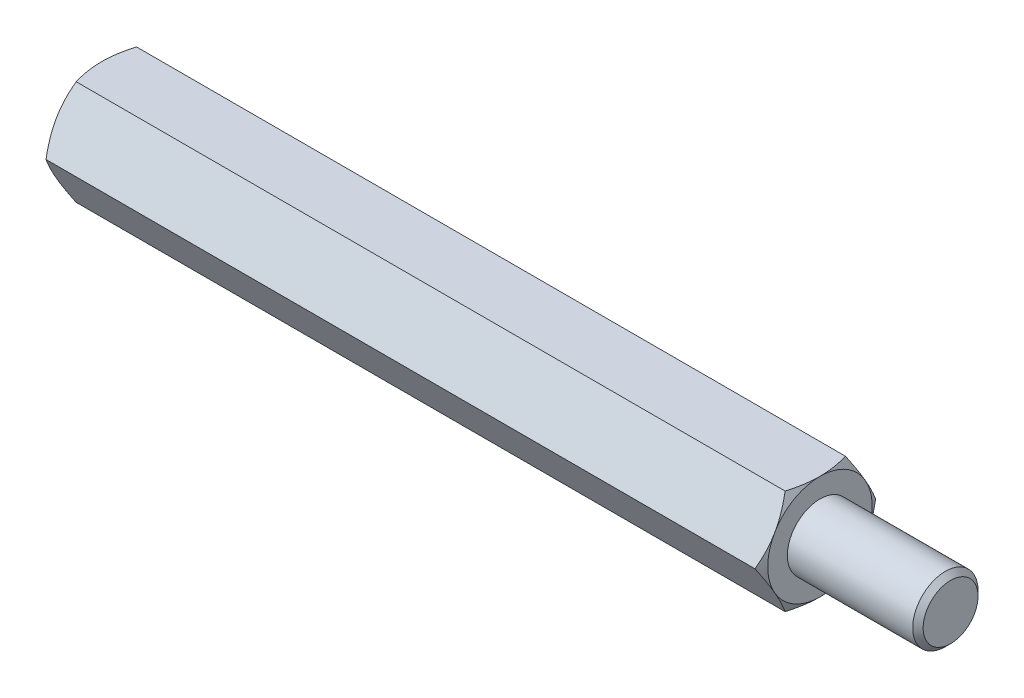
ISO-10303-21;
HEADER;
FILE_DESCRIPTION(('STEP AP214'),'2;1');
FILE_NAME('part.step','',(''),(''),'','','');
FILE_SCHEMA(('AUTOMOTIVE_DESIGN { 1 0 10303 214 1 1 1 1 }'));
ENDSEC;
DATA;
#1=APPLICATION_CONTEXT('core data for automotive mechanical design processes');
#2=APPLICATION_PROTOCOL_DEFINITION('international standard','automotive_design',2000,#1);
#3=PRODUCT_CONTEXT('',#1,'mechanical');
#4=PRODUCT('Part','Part','',(#3));
#5=PRODUCT_RELATED_PRODUCT_CATEGORY('part','',(#4));
#6=PRODUCT_DEFINITION_FORMATION('','',#4);
#7=PRODUCT_DEFINITION_CONTEXT('part definition',#1,'design');
#8=PRODUCT_DEFINITION('design','',#6,#7);
#9=PRODUCT_DEFINITION_SHAPE('','',#8);
#10=(LENGTH_UNIT() NAMED_UNIT(*) SI_UNIT(.MILLI.,.METRE.));
#11=(NAMED_UNIT(*) PLANE_ANGLE_UNIT() SI_UNIT($,.RADIAN.));
#12=(NAMED_UNIT(*) SI_UNIT($,.STERADIAN.) SOLID_ANGLE_UNIT());
#13=UNCERTAINTY_MEASURE_WITH_UNIT(LENGTH_MEASURE(1.E-05),#10,'distance_accuracy_value','');
#14=(GEOMETRIC_REPRESENTATION_CONTEXT(3) GLOBAL_UNCERTAINTY_ASSIGNED_CONTEXT((#13)) GLOBAL_UNIT_ASSIGNED_CONTEXT((#10,
#11,#12)) REPRESENTATION_CONTEXT('',''));
#15=CARTESIAN_POINT('',(0.,0.,0.));
#16=DIRECTION('',(0.,0.,1.));
#17=DIRECTION('',(1.,0.,0.));
#18=AXIS2_PLACEMENT_3D('',#15,#16,#17);
#19=CARTESIAN_POINT('',(27.5,4.,-2.3094010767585));
#20=DIRECTION('',(1.,0.,0.));
#21=DIRECTION('',(0.,0.,-1.));
#22=AXIS2_PLACEMENT_3D('',#19,#20,#21);
#23=PLANE('',#22);
#24=CARTESIAN_POINT('',(27.5,0.,0.));
#25=DIRECTION('',(1.,0.,0.));
#26=DIRECTION('',(0.,0.,-1.));
#27=AXIS2_PLACEMENT_3D('',#24,#25,#26);
#28=CIRCLE('',#27,4.);
#29=CARTESIAN_POINT('',(27.5,-2.,-3.46410161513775));
#30=VERTEX_POINT('',#29);
#31=CARTESIAN_POINT('',(27.5,2.,-3.46410161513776));
#32=VERTEX_POINT('',#31);
#33=EDGE_CURVE('E288',#30,#32,#28,.T.);
#34=ORIENTED_EDGE('',*,*,#33,.T.);
#35=CARTESIAN_POINT('',(27.5,4.,0.));
#36=VERTEX_POINT('',#35);
#37=EDGE_CURVE('E53',#32,#36,#28,.T.);
#38=ORIENTED_EDGE('',*,*,#37,.T.);
#39=CARTESIAN_POINT('',(27.5,2.,3.46410161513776));
#40=VERTEX_POINT('',#39);
#41=EDGE_CURVE('E297',#36,#40,#28,.T.);
#42=ORIENTED_EDGE('',*,*,#41,.T.);
#43=CARTESIAN_POINT('',(27.5,-2.00000000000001,3.46410161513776));
#44=VERTEX_POINT('',#43);
#45=EDGE_CURVE('E303',#40,#44,#28,.T.);
#46=ORIENTED_EDGE('',*,*,#45,.T.);
#47=CARTESIAN_POINT('',(27.5,0.,0.));
#48=DIRECTION('',(-1.,0.,0.));
#49=DIRECTION('',(0.,-1.,0.));
#50=AXIS2_PLACEMENT_3D('',#47,#48,#49);
#51=CIRCLE('',#50,4.);
#52=CARTESIAN_POINT('',(27.5,-4.00000000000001,0.));
#53=VERTEX_POINT('',#52);
#54=EDGE_CURVE('E193',#53,#44,#51,.T.);
#55=ORIENTED_EDGE('',*,*,#54,.F.);
#56=EDGE_CURVE('E61',#53,#30,#28,.T.);
#57=ORIENTED_EDGE('',*,*,#56,.T.);
#58=EDGE_LOOP('',(#34,#38,#42,#46,#55,#57));
#59=FACE_BOUND('',#58,.T.);
#60=CARTESIAN_POINT('',(27.5,0.,0.));
#61=DIRECTION('',(1.,0.,0.));
#62=DIRECTION('',(0.,0.,-1.));
#63=AXIS2_PLACEMENT_3D('',#60,#61,#62);
#64=CIRCLE('',#63,2.5);
#65=CARTESIAN_POINT('',(27.5,0.,-2.5));
#66=VERTEX_POINT('',#65);
#67=EDGE_CURVE('E313',#66,#66,#64,.T.);
#68=ORIENTED_EDGE('',*,*,#67,.F.);
#69=EDGE_LOOP('',(#68));
#70=FACE_BOUND('',#69,.T.);
#71=ADVANCED_FACE('F37',(#59,#70),#23,.T.);
#72=CARTESIAN_POINT('',(27.5,0.,-4.61880215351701));
#73=DIRECTION('',(0.,-0.5,0.866025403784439));
#74=DIRECTION('',(0.,-0.866025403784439,-0.5));
#75=AXIS2_PLACEMENT_3D('',#72,#73,#74);
#76=PLANE('',#75);
#77=CARTESIAN_POINT('',(27.1426677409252,-0.000200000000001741,-4.61891762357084));
#78=CARTESIAN_POINT('',(27.2012821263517,0.175579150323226,-4.5174314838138));
#79=CARTESIAN_POINT('',(27.2545896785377,0.352875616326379,-4.41506932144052));
#80=CARTESIAN_POINT('',(27.3476383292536,0.710538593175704,-4.2085725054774));
#81=CARTESIAN_POINT('',(27.3873465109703,0.890911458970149,-4.10443418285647));
#82=CARTESIAN_POINT('',(27.4491577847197,1.24942181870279,-3.89744813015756));
#83=CARTESIAN_POINT('',(27.4716722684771,1.42750415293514,-3.79463224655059));
#84=CARTESIAN_POINT('',(27.4985493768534,1.78450671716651,-3.58851671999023));
#85=CARTESIAN_POINT('',(27.5029342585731,1.9634256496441,-3.48521782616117));
#86=CARTESIAN_POINT('',(27.49380992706,2.29774284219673,-3.29219970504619));
#87=CARTESIAN_POINT('',(27.482541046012,2.45319115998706,-3.20245157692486));
#88=CARTESIAN_POINT('',(27.4468260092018,2.76307505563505,-3.02354002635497));
#89=CARTESIAN_POINT('',(27.4223676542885,2.91750956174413,-2.93437722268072));
#90=CARTESIAN_POINT('',(27.3612239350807,3.22803232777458,-2.75509682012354));
#91=CARTESIAN_POINT('',(27.3242793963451,3.3840812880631,-2.6650019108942));
#92=CARTESIAN_POINT('',(27.240429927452,3.69385183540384,-2.486155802));
#93=CARTESIAN_POINT('',(27.1935446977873,3.84757739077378,-2.39740231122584));
#94=CARTESIAN_POINT('',(27.1426677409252,4.0002,-2.30928560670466));
#95=B_SPLINE_CURVE_WITH_KNOTS('',3,(#77,#78,#79,#80,#81,#82,#83,#84,#85,#86,#87,#88,#89,#90,#91,
#92,#93,#94),.UNSPECIFIED.,.F.,.F.,(4,2,2,2,2,2,2,2,4),(0.,0.634047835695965,1.26961969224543,
1.88946157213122,2.50854226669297,3.04757825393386,3.58711366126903,4.13861653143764,
4.68903648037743),.UNSPECIFIED.);
#96=CARTESIAN_POINT('',(27.1427344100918,0.,-4.61880215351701));
#97=VERTEX_POINT('',#96);
#98=EDGE_CURVE('E610',#97,#32,#95,.T.);
#99=ORIENTED_EDGE('',*,*,#98,.F.);
#100=DIRECTION('',(-1.,0.,0.));
#101=VECTOR('',#100,1.);
#102=CARTESIAN_POINT('',(27.5,0.,-4.61880215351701));
#103=LINE('',#102,#101);
#104=CARTESIAN_POINT('',(-27.1427344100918,0.,-4.61880215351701));
#105=VERTEX_POINT('',#104);
#106=EDGE_CURVE('E264',#97,#105,#103,.T.);
#107=ORIENTED_EDGE('',*,*,#106,.T.);
#108=CARTESIAN_POINT('',(-27.1426677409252,4.0002,-2.30928560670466));
#109=CARTESIAN_POINT('',(-27.2012821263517,3.82442084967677,-2.4107717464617));
#110=CARTESIAN_POINT('',(-27.2545896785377,3.64712438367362,-2.51313390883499));
#111=CARTESIAN_POINT('',(-27.3476383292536,3.28946140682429,-2.71963072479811));
#112=CARTESIAN_POINT('',(-27.3873465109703,3.10908854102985,-2.82376904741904));
#113=CARTESIAN_POINT('',(-27.4491577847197,2.75057818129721,-3.03075510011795));
#114=CARTESIAN_POINT('',(-27.4716722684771,2.57249584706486,-3.13357098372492));
#115=CARTESIAN_POINT('',(-27.4985493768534,2.21549328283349,-3.33968651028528));
#116=CARTESIAN_POINT('',(-27.5029342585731,2.0365743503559,-3.44298540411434));
#117=CARTESIAN_POINT('',(-27.49380992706,1.70225715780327,-3.63600352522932));
#118=CARTESIAN_POINT('',(-27.482541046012,1.54680884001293,-3.72575165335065));
#119=CARTESIAN_POINT('',(-27.4468260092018,1.23692494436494,-3.90466320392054));
#120=CARTESIAN_POINT('',(-27.4223676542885,1.08249043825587,-3.99382600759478));
#121=CARTESIAN_POINT('',(-27.3612239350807,0.771967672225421,-4.17310641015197));
#122=CARTESIAN_POINT('',(-27.3242793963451,0.615918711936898,-4.26320131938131));
#123=CARTESIAN_POINT('',(-27.240429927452,0.306148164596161,-4.4420474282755));
#124=CARTESIAN_POINT('',(-27.1935446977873,0.15242260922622,-4.53080091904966));
#125=CARTESIAN_POINT('',(-27.1426677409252,-0.000200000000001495,-4.61891762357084));
#126=B_SPLINE_CURVE_WITH_KNOTS('',3,(#108,#109,#110,#111,#112,#113,#114,#115,#116,#117,#118,
#119,#120,#121,#122,#123,#124,#125),.UNSPECIFIED.,.F.,.F.,(4,2,2,2,2,2,2,2,4),(0.,
0.634047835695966,1.26961969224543,1.88946157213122,2.50854226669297,3.04757825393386,
3.58711366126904,4.13861653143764,4.68903648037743),.UNSPECIFIED.);
#127=CARTESIAN_POINT('',(-27.5,2.,-3.46410161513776));
#128=VERTEX_POINT('',#127);
#129=EDGE_CURVE('E363',#128,#105,#126,.T.);
#130=ORIENTED_EDGE('',*,*,#129,.F.);
#131=CARTESIAN_POINT('',(-27.1427344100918,4.,-2.3094010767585));
#132=VERTEX_POINT('',#131);
#133=EDGE_CURVE('E359',#132,#128,#126,.T.);
#134=ORIENTED_EDGE('',*,*,#133,.F.);
#135=DIRECTION('',(-1.,0.,0.));
#136=VECTOR('',#135,1.);
#137=CARTESIAN_POINT('',(27.5,4.,-2.3094010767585));
#138=LINE('',#137,#136);
#139=CARTESIAN_POINT('',(27.142734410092,4.,-2.30940107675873));
#140=VERTEX_POINT('',#139);
#141=EDGE_CURVE('E279',#140,#132,#138,.T.);
#142=ORIENTED_EDGE('',*,*,#141,.F.);
#143=EDGE_CURVE('E229',#32,#140,#95,.T.);
#144=ORIENTED_EDGE('',*,*,#143,.F.);
#145=EDGE_LOOP('',(#99,#107,#130,#134,#142,#144));
#146=FACE_BOUND('',#145,.T.);
#147=ADVANCED_FACE('F148',(#146),#76,.F.);
#148=CARTESIAN_POINT('',(27.5,4.,-2.3094010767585));
#149=DIRECTION('',(0.,-1.,0.));
#150=DIRECTION('',(0.,0.,-1.));
#151=AXIS2_PLACEMENT_3D('',#148,#149,#150);
#152=PLANE('',#151);
#153=CARTESIAN_POINT('',(25.5082907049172,4.,-6.28479524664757));
#154=CARTESIAN_POINT('',(25.5937006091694,4.,-6.10939349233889));
#155=CARTESIAN_POINT('',(25.6783148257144,4.,-5.93359774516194));
#156=CARTESIAN_POINT('',(25.8455059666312,4.,-5.58100905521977));
#157=CARTESIAN_POINT('',(25.9280825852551,4.,-5.40421596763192));
#158=CARTESIAN_POINT('',(26.0911508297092,4.,-5.04855089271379));
#159=CARTESIAN_POINT('',(26.1716293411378,4.,-4.86967287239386));
#160=CARTESIAN_POINT('',(26.329400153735,4.,-4.51052237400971));
#161=CARTESIAN_POINT('',(26.406692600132,4.,-4.33024995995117));
#162=CARTESIAN_POINT('',(26.559802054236,4.,-3.96189114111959));
#163=CARTESIAN_POINT('',(26.635480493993,4.,-3.77374683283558));
#164=CARTESIAN_POINT('',(26.7813045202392,4.,-3.39528725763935));
#165=CARTESIAN_POINT('',(26.8514494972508,4.,-3.2049717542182));
#166=CARTESIAN_POINT('',(26.9844245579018,4.,-2.82219775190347));
#167=CARTESIAN_POINT('',(27.0472687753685,4.,-2.62974421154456));
#168=CARTESIAN_POINT('',(27.1636796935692,4.,-2.24207725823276));
#169=CARTESIAN_POINT('',(27.2172492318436,4.,-2.04686470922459));
#170=CARTESIAN_POINT('',(27.3123031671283,4.,-1.65467425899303));
#171=CARTESIAN_POINT('',(27.3538563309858,4.,-1.45771333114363));
#172=CARTESIAN_POINT('',(27.4225903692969,4.,-1.06125849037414));
#173=CARTESIAN_POINT('',(27.4497727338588,4.,-0.861764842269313));
#174=CARTESIAN_POINT('',(27.4872447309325,4.,-0.463879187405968));
#175=CARTESIAN_POINT('',(27.4977578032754,4.,-0.265508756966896));
#176=CARTESIAN_POINT('',(27.5015934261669,4.,0.131417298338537));
#177=CARTESIAN_POINT('',(27.4949158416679,4.,0.329972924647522));
#178=CARTESIAN_POINT('',(27.4696489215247,4.,0.664692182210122));
#179=CARTESIAN_POINT('',(27.4553708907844,4.,0.801202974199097));
#180=CARTESIAN_POINT('',(27.4195349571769,4.,1.07327201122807));
#181=CARTESIAN_POINT('',(27.3979761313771,4.,1.20883013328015));
#182=CARTESIAN_POINT('',(27.3235066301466,4.,1.61386939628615));
#183=CARTESIAN_POINT('',(27.2608149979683,4.,1.8815748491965));
#184=CARTESIAN_POINT('',(27.1515117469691,4.,2.28197262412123));
#185=CARTESIAN_POINT('',(27.112009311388,4.,2.41672443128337));
#186=CARTESIAN_POINT('',(27.0287523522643,4.,2.68492067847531));
#187=CARTESIAN_POINT('',(26.9849977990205,4.,2.81836510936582));
#188=CARTESIAN_POINT('',(26.8939510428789,4.,3.08398596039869));
#189=CARTESIAN_POINT('',(26.846659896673,4.,3.21616274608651));
#190=CARTESIAN_POINT('',(26.7491111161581,4.,3.47941134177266));
#191=CARTESIAN_POINT('',(26.6988535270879,4.,3.61048316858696));
#192=CARTESIAN_POINT('',(26.5713295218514,4.,3.93385125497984));
#193=CARTESIAN_POINT('',(26.4926014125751,4.,4.1255702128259));
#194=CARTESIAN_POINT('',(26.3309693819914,4.,4.5072455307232));
#195=CARTESIAN_POINT('',(26.2480651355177,4.,4.69720175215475));
#196=CARTESIAN_POINT('',(26.0789699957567,4.,5.07569950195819));
#197=CARTESIAN_POINT('',(25.9927782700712,4.,5.26424065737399));
#198=CARTESIAN_POINT('',(25.8178011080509,4.,5.64011758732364));
#199=CARTESIAN_POINT('',(25.7290156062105,4.,5.82745333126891));
#200=CARTESIAN_POINT('',(25.4593432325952,4.,6.38844423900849));
#201=CARTESIAN_POINT('',(25.2753561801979,4.,6.76060781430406));
#202=CARTESIAN_POINT('',(24.9019562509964,4.,7.50211228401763));
#203=CARTESIAN_POINT('',(24.7125442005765,4.,7.87145359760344));
#204=CARTESIAN_POINT('',(24.3473877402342,4.,8.57450173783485));
#205=CARTESIAN_POINT('',(24.171975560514,4.,8.90838144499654));
#206=CARTESIAN_POINT('',(23.8188097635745,4.,9.57491712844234));
#207=CARTESIAN_POINT('',(23.6410560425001,4.,9.90757304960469));
#208=CARTESIAN_POINT('',(23.2842933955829,4.,10.5709822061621));
#209=CARTESIAN_POINT('',(23.105289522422,3.99999999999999,10.9017381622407));
#210=CARTESIAN_POINT('',(22.7459071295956,3.99999999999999,11.5624752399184));
#211=CARTESIAN_POINT('',(22.5655286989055,3.99999999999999,11.8924564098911));
#212=CARTESIAN_POINT('',(22.384642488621,3.99999999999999,12.2221569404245));
#213=B_SPLINE_CURVE_WITH_KNOTS('',3,(#153,#154,#155,#156,#157,#158,#159,#160,#161,#162,#163,
#164,#165,#166,#167,#168,#169,#170,#171,#172,#173,#174,#175,#176,#177,#178,#179,#180,#181,#182,
#183,#184,#185,#186,#187,#188,#189,#190,#191,#192,#193,#194,#195,#196,#197,#198,#199,#200,#201,
#202,#203,#204,#205,#206,#207,#208,#209,#210,#211,#212),.UNSPECIFIED.,.F.,.F.,(4,2,2,2,2,2,2,2,
2,2,2,2,2,2,2,2,2,2,2,2,2,2,2,2,2,2,2,2,2,4),(0.,0.585280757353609,1.17064881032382,
1.75906864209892,2.34746162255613,2.9557770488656,3.56415938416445,4.17134357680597,
4.77834167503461,5.38179402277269,5.98518378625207,6.58041501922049,7.17565092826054,
7.5872191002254,7.99883946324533,8.82250155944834,9.24373134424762,9.66496407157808,
10.086071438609,10.5071723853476,11.1288656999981,11.7506074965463,12.3725077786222,
12.9944237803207,14.2398211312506,15.4850297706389,16.6164791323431,17.7479788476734,
18.8762380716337,20.0044248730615),.UNSPECIFIED.);
#214=EDGE_CURVE('E227',#140,#36,#213,.T.);
#215=ORIENTED_EDGE('',*,*,#214,.F.);
#216=ORIENTED_EDGE('',*,*,#141,.T.);
#217=CARTESIAN_POINT('',(-25.5082907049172,4.,-6.28479524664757));
#218=CARTESIAN_POINT('',(-25.5937006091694,4.,-6.10939349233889));
#219=CARTESIAN_POINT('',(-25.6783148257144,4.,-5.93359774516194));
#220=CARTESIAN_POINT('',(-25.8455059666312,4.,-5.58100905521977));
#221=CARTESIAN_POINT('',(-25.9280825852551,4.,-5.40421596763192));
#222=CARTESIAN_POINT('',(-26.0911508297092,4.,-5.04855089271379));
#223=CARTESIAN_POINT('',(-26.1716293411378,4.,-4.86967287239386));
#224=CARTESIAN_POINT('',(-26.329400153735,4.,-4.51052237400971));
#225=CARTESIAN_POINT('',(-26.406692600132,4.,-4.33024995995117));
#226=CARTESIAN_POINT('',(-26.559802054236,4.,-3.96189114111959));
#227=CARTESIAN_POINT('',(-26.635480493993,4.,-3.77374683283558));
#228=CARTESIAN_POINT('',(-26.7813045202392,4.,-3.39528725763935));
#229=CARTESIAN_POINT('',(-26.8514494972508,4.,-3.2049717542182));
#230=CARTESIAN_POINT('',(-26.9844245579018,4.,-2.82219775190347));
#231=CARTESIAN_POINT('',(-27.0472687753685,4.,-2.62974421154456));
#232=CARTESIAN_POINT('',(-27.1636796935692,4.,-2.24207725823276));
#233=CARTESIAN_POINT('',(-27.2172492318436,4.,-2.04686470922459));
#234=CARTESIAN_POINT('',(-27.3123031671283,4.,-1.65467425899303));
#235=CARTESIAN_POINT('',(-27.3538563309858,4.,-1.45771333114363));
#236=CARTESIAN_POINT('',(-27.4225903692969,4.,-1.06125849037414));
#237=CARTESIAN_POINT('',(-27.4497727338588,4.,-0.861764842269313));
#238=CARTESIAN_POINT('',(-27.4872447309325,4.,-0.463879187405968));
#239=CARTESIAN_POINT('',(-27.4977578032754,4.,-0.265508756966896));
#240=CARTESIAN_POINT('',(-27.5015934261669,4.,0.131417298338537));
#241=CARTESIAN_POINT('',(-27.4949158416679,4.,0.329972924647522));
#242=CARTESIAN_POINT('',(-27.4696489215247,4.,0.664692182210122));
#243=CARTESIAN_POINT('',(-27.4553708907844,4.,0.801202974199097));
#244=CARTESIAN_POINT('',(-27.4195349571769,4.,1.07327201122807));
#245=CARTESIAN_POINT('',(-27.3979761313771,4.,1.20883013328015));
#246=CARTESIAN_POINT('',(-27.3235066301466,4.,1.61386939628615));
#247=CARTESIAN_POINT('',(-27.2608149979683,4.,1.8815748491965));
#248=CARTESIAN_POINT('',(-27.1515117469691,4.,2.28197262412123));
#249=CARTESIAN_POINT('',(-27.112009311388,4.,2.41672443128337));
#250=CARTESIAN_POINT('',(-27.0287523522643,4.,2.68492067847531));
#251=CARTESIAN_POINT('',(-26.9849977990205,4.,2.81836510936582));
#252=CARTESIAN_POINT('',(-26.8939510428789,4.,3.08398596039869));
#253=CARTESIAN_POINT('',(-26.846659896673,4.,3.21616274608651));
#254=CARTESIAN_POINT('',(-26.7491111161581,4.,3.47941134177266));
#255=CARTESIAN_POINT('',(-26.6988535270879,4.,3.61048316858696));
#256=CARTESIAN_POINT('',(-26.5713295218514,4.,3.93385125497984));
#257=CARTESIAN_POINT('',(-26.4926014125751,4.,4.1255702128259));
#258=CARTESIAN_POINT('',(-26.3309693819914,4.,4.5072455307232));
#259=CARTESIAN_POINT('',(-26.2480651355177,4.,4.69720175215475));
#260=CARTESIAN_POINT('',(-26.0789699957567,4.,5.07569950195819));
#261=CARTESIAN_POINT('',(-25.9927782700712,4.,5.26424065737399));
#262=CARTESIAN_POINT('',(-25.8178011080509,4.,5.64011758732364));
#263=CARTESIAN_POINT('',(-25.7290156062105,4.,5.82745333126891));
#264=CARTESIAN_POINT('',(-25.4593432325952,4.,6.38844423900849));
#265=CARTESIAN_POINT('',(-25.2753561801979,4.,6.76060781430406));
#266=CARTESIAN_POINT('',(-24.9019562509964,4.,7.50211228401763));
#267=CARTESIAN_POINT('',(-24.7125442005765,4.,7.87145359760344));
#268=CARTESIAN_POINT('',(-24.3473877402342,4.,8.57450173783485));
#269=CARTESIAN_POINT('',(-24.171975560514,4.,8.90838144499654));
#270=CARTESIAN_POINT('',(-23.8188097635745,4.,9.57491712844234));
#271=CARTESIAN_POINT('',(-23.6410560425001,4.,9.90757304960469));
#272=CARTESIAN_POINT('',(-23.2842933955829,4.,10.5709822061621));
#273=CARTESIAN_POINT('',(-23.105289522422,3.99999999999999,10.9017381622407));
#274=CARTESIAN_POINT('',(-22.7459071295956,3.99999999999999,11.5624752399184));
#275=CARTESIAN_POINT('',(-22.5655286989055,3.99999999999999,11.8924564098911));
#276=CARTESIAN_POINT('',(-22.384642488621,3.99999999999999,12.2221569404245));
#277=B_SPLINE_CURVE_WITH_KNOTS('',3,(#217,#218,#219,#220,#221,#222,#223,#224,#225,#226,#227,
#228,#229,#230,#231,#232,#233,#234,#235,#236,#237,#238,#239,#240,#241,#242,#243,#244,#245,#246,
#247,#248,#249,#250,#251,#252,#253,#254,#255,#256,#257,#258,#259,#260,#261,#262,#263,#264,#265,
#266,#267,#268,#269,#270,#271,#272,#273,#274,#275,#276),.UNSPECIFIED.,.F.,.F.,(4,2,2,2,2,2,2,2,
2,2,2,2,2,2,2,2,2,2,2,2,2,2,2,2,2,2,2,2,2,4),(0.,0.585280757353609,1.17064881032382,
1.75906864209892,2.34746162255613,2.9557770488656,3.56415938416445,4.17134357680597,
4.77834167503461,5.38179402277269,5.98518378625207,6.58041501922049,7.17565092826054,
7.5872191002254,7.99883946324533,8.82250155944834,9.24373134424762,9.66496407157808,
10.086071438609,10.5071723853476,11.1288656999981,11.7506074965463,12.3725077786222,
12.9944237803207,14.2398211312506,15.4850297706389,16.6164791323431,17.7479788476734,
18.8762380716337,20.0044248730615),.UNSPECIFIED.);
#278=CARTESIAN_POINT('',(-27.5,4.,0.));
#279=VERTEX_POINT('',#278);
#280=EDGE_CURVE('E241',#279,#132,#277,.F.);
#281=ORIENTED_EDGE('',*,*,#280,.F.);
#282=CARTESIAN_POINT('',(-27.1427344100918,4.,2.3094010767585));
#283=VERTEX_POINT('',#282);
#284=EDGE_CURVE('E249',#283,#279,#277,.F.);
#285=ORIENTED_EDGE('',*,*,#284,.F.);
#286=DIRECTION('',(-1.,0.,0.));
#287=VECTOR('',#286,1.);
#288=CARTESIAN_POINT('',(27.5,4.,2.3094010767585));
#289=LINE('',#288,#287);
#290=CARTESIAN_POINT('',(27.1427344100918,4.,2.3094010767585));
#291=VERTEX_POINT('',#290);
#292=EDGE_CURVE('E276',#291,#283,#289,.T.);
#293=ORIENTED_EDGE('',*,*,#292,.F.);
#294=EDGE_CURVE('E221',#36,#291,#213,.T.);
#295=ORIENTED_EDGE('',*,*,#294,.F.);
#296=EDGE_LOOP('',(#215,#216,#281,#285,#293,#295));
#297=FACE_BOUND('',#296,.T.);
#298=ADVANCED_FACE('F153',(#297),#152,.F.);
#299=CARTESIAN_POINT('',(27.5,4.,2.3094010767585));
#300=DIRECTION('',(0.,-0.5,-0.866025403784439));
#301=DIRECTION('',(0.,0.866025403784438,-0.5));
#302=AXIS2_PLACEMENT_3D('',#299,#300,#301);
#303=PLANE('',#302);
#304=CARTESIAN_POINT('',(27.1426677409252,4.0002,2.30928560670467));
#305=CARTESIAN_POINT('',(27.2012821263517,3.82442084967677,2.4107717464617));
#306=CARTESIAN_POINT('',(27.2545896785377,3.64712438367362,2.51313390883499));
#307=CARTESIAN_POINT('',(27.3476383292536,3.28946140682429,2.71963072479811));
#308=CARTESIAN_POINT('',(27.3873465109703,3.10908854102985,2.82376904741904));
#309=CARTESIAN_POINT('',(27.4491577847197,2.75057818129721,3.03075510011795));
#310=CARTESIAN_POINT('',(27.4716722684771,2.57249584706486,3.13357098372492));
#311=CARTESIAN_POINT('',(27.4985493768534,2.21549328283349,3.33968651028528));
#312=CARTESIAN_POINT('',(27.5029342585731,2.0365743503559,3.44298540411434));
#313=CARTESIAN_POINT('',(27.49380992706,1.70225715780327,3.63600352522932));
#314=CARTESIAN_POINT('',(27.482541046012,1.54680884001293,3.72575165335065));
#315=CARTESIAN_POINT('',(27.4468260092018,1.23692494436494,3.90466320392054));
#316=CARTESIAN_POINT('',(27.4223676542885,1.08249043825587,3.99382600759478));
#317=CARTESIAN_POINT('',(27.3612239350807,0.771967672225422,4.17310641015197));
#318=CARTESIAN_POINT('',(27.3242793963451,0.615918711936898,4.26320131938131));
#319=CARTESIAN_POINT('',(27.240429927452,0.306148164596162,4.4420474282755));
#320=CARTESIAN_POINT('',(27.1935446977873,0.152422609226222,4.53080091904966));
#321=CARTESIAN_POINT('',(27.1426677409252,-0.000199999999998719,4.61891762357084));
#322=B_SPLINE_CURVE_WITH_KNOTS('',3,(#304,#305,#306,#307,#308,#309,#310,#311,#312,#313,#314,
#315,#316,#317,#318,#319,#320,#321),.UNSPECIFIED.,.F.,.F.,(4,2,2,2,2,2,2,2,4),(0.,
0.634047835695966,1.26961969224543,1.88946157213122,2.50854226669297,3.04757825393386,
3.58711366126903,4.13861653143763,4.68903648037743),.UNSPECIFIED.);
#323=EDGE_CURVE('E228',#291,#40,#322,.T.);
#324=ORIENTED_EDGE('',*,*,#323,.F.);
#325=ORIENTED_EDGE('',*,*,#292,.T.);
#326=CARTESIAN_POINT('',(-27.1426677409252,-0.000199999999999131,4.61891762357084));
#327=CARTESIAN_POINT('',(-27.2012821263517,0.175579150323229,4.5174314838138));
#328=CARTESIAN_POINT('',(-27.2545896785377,0.352875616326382,4.41506932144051));
#329=CARTESIAN_POINT('',(-27.3476383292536,0.710538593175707,4.20857250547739));
#330=CARTESIAN_POINT('',(-27.3873465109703,0.890911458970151,4.10443418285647));
#331=CARTESIAN_POINT('',(-27.4491577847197,1.24942181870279,3.89744813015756));
#332=CARTESIAN_POINT('',(-27.4716722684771,1.42750415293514,3.79463224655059));
#333=CARTESIAN_POINT('',(-27.4985493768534,1.78450671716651,3.58851671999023));
#334=CARTESIAN_POINT('',(-27.5029342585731,1.9634256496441,3.48521782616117));
#335=CARTESIAN_POINT('',(-27.49380992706,2.29774284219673,3.29219970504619));
#336=CARTESIAN_POINT('',(-27.482541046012,2.45319115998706,3.20245157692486));
#337=CARTESIAN_POINT('',(-27.4468260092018,2.76307505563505,3.02354002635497));
#338=CARTESIAN_POINT('',(-27.4223676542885,2.91750956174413,2.93437722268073));
#339=CARTESIAN_POINT('',(-27.3612239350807,3.22803232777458,2.75509682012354));
#340=CARTESIAN_POINT('',(-27.3242793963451,3.3840812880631,2.6650019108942));
#341=CARTESIAN_POINT('',(-27.240429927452,3.69385183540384,2.48615580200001));
#342=CARTESIAN_POINT('',(-27.1935446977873,3.84757739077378,2.39740231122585));
#343=CARTESIAN_POINT('',(-27.1426677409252,4.0002,2.30928560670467));
#344=B_SPLINE_CURVE_WITH_KNOTS('',3,(#326,#327,#328,#329,#330,#331,#332,#333,#334,#335,#336,
#337,#338,#339,#340,#341,#342,#343),.UNSPECIFIED.,.F.,.F.,(4,2,2,2,2,2,2,2,4),(0.,
0.634047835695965,1.26961969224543,1.88946157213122,2.50854226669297,3.04757825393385,
3.58711366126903,4.13861653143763,4.68903648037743),.UNSPECIFIED.);
#345=CARTESIAN_POINT('',(-27.5,2.,3.46410161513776));
#346=VERTEX_POINT('',#345);
#347=EDGE_CURVE('E255',#346,#283,#344,.T.);
#348=ORIENTED_EDGE('',*,*,#347,.F.);
#349=CARTESIAN_POINT('',(-27.1427344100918,0.,4.618802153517));
#350=VERTEX_POINT('',#349);
#351=EDGE_CURVE('E262',#350,#346,#344,.T.);
#352=ORIENTED_EDGE('',*,*,#351,.F.);
#353=DIRECTION('',(-1.,0.,0.));
#354=VECTOR('',#353,1.);
#355=CARTESIAN_POINT('',(27.5,0.,4.618802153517));
#356=LINE('',#355,#354);
#357=CARTESIAN_POINT('',(27.1427344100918,0.,4.618802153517));
#358=VERTEX_POINT('',#357);
#359=EDGE_CURVE('E273',#358,#350,#356,.T.);
#360=ORIENTED_EDGE('',*,*,#359,.F.);
#361=EDGE_CURVE('E215',#40,#358,#322,.T.);
#362=ORIENTED_EDGE('',*,*,#361,.F.);
#363=EDGE_LOOP('',(#324,#325,#348,#352,#360,#362));
#364=FACE_BOUND('',#363,.T.);
#365=ADVANCED_FACE('F235',(#364),#303,.F.);
#366=CARTESIAN_POINT('',(27.5,0.,4.618802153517));
#367=DIRECTION('',(0.,0.5,-0.866025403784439));
#368=DIRECTION('',(0.,0.866025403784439,0.5));
#369=AXIS2_PLACEMENT_3D('',#366,#367,#368);
#370=PLANE('',#369);
#371=CARTESIAN_POINT('',(27.1426677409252,0.000200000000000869,4.61891762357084));
#372=CARTESIAN_POINT('',(27.2012821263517,-0.175579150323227,4.5174314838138));
#373=CARTESIAN_POINT('',(27.2545896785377,-0.35287561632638,4.41506932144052));
#374=CARTESIAN_POINT('',(27.3476383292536,-0.710538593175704,4.20857250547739));
#375=CARTESIAN_POINT('',(27.3873465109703,-0.890911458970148,4.10443418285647));
#376=CARTESIAN_POINT('',(27.4491577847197,-1.24942181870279,3.89744813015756));
#377=CARTESIAN_POINT('',(27.4716722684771,-1.42750415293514,3.79463224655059));
#378=CARTESIAN_POINT('',(27.4985493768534,-1.78450671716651,3.58851671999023));
#379=CARTESIAN_POINT('',(27.5029342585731,-1.9634256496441,3.48521782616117));
#380=CARTESIAN_POINT('',(27.49380992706,-2.29774284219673,3.29219970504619));
#381=CARTESIAN_POINT('',(27.482541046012,-2.45319115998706,3.20245157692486));
#382=CARTESIAN_POINT('',(27.4468260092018,-2.76307505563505,3.02354002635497));
#383=CARTESIAN_POINT('',(27.4223676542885,-2.91750956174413,2.93437722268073));
#384=CARTESIAN_POINT('',(27.3612239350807,-3.22803232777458,2.75509682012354));
#385=CARTESIAN_POINT('',(27.3242793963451,-3.3840812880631,2.6650019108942));
#386=CARTESIAN_POINT('',(27.240429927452,-3.69385183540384,2.48615580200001));
#387=CARTESIAN_POINT('',(27.1935446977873,-3.84757739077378,2.39740231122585));
#388=CARTESIAN_POINT('',(27.1426677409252,-4.0002,2.30928560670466));
#389=B_SPLINE_CURVE_WITH_KNOTS('',3,(#371,#372,#373,#374,#375,#376,#377,#378,#379,#380,#381,
#382,#383,#384,#385,#386,#387,#388),.UNSPECIFIED.,.F.,.F.,(4,2,2,2,2,2,2,2,4),(0.,
0.634047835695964,1.26961969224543,1.88946157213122,2.50854226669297,3.04757825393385,
3.58711366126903,4.13861653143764,4.68903648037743),.UNSPECIFIED.);
#390=EDGE_CURVE('E397',#358,#44,#389,.T.);
#391=ORIENTED_EDGE('',*,*,#390,.F.);
#392=ORIENTED_EDGE('',*,*,#359,.T.);
#393=CARTESIAN_POINT('',(-27.1426677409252,-4.0002,2.30928560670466));
#394=CARTESIAN_POINT('',(-27.2012821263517,-3.82442084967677,2.4107717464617));
#395=CARTESIAN_POINT('',(-27.2545896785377,-3.64712438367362,2.51313390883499));
#396=CARTESIAN_POINT('',(-27.3476383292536,-3.2894614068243,2.71963072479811));
#397=CARTESIAN_POINT('',(-27.3873465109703,-3.10908854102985,2.82376904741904));
#398=CARTESIAN_POINT('',(-27.4491577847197,-2.75057818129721,3.03075510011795));
#399=CARTESIAN_POINT('',(-27.4716722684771,-2.57249584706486,3.13357098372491));
#400=CARTESIAN_POINT('',(-27.4985493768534,-2.21549328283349,3.33968651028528));
#401=CARTESIAN_POINT('',(-27.5029342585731,-2.0365743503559,3.44298540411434));
#402=CARTESIAN_POINT('',(-27.49380992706,-1.70225715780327,3.63600352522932));
#403=CARTESIAN_POINT('',(-27.482541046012,-1.54680884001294,3.72575165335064));
#404=CARTESIAN_POINT('',(-27.4468260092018,-1.23692494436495,3.90466320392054));
#405=CARTESIAN_POINT('',(-27.4223676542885,-1.08249043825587,3.99382600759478));
#406=CARTESIAN_POINT('',(-27.3612239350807,-0.771967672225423,4.17310641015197));
#407=CARTESIAN_POINT('',(-27.3242793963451,-0.615918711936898,4.26320131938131));
#408=CARTESIAN_POINT('',(-27.240429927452,-0.30614816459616,4.4420474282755));
#409=CARTESIAN_POINT('',(-27.1935446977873,-0.15242260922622,4.53080091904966));
#410=CARTESIAN_POINT('',(-27.1426677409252,0.000200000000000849,4.61891762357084));
#411=B_SPLINE_CURVE_WITH_KNOTS('',3,(#393,#394,#395,#396,#397,#398,#399,#400,#401,#402,#403,
#404,#405,#406,#407,#408,#409,#410),.UNSPECIFIED.,.F.,.F.,(4,2,2,2,2,2,2,2,4),(0.,
0.634047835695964,1.26961969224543,1.88946157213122,2.50854226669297,3.04757825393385,
3.58711366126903,4.13861653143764,4.68903648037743),.UNSPECIFIED.);
#412=CARTESIAN_POINT('',(-27.5,-2.00000000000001,3.46410161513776));
#413=VERTEX_POINT('',#412);
#414=EDGE_CURVE('E263',#413,#350,#411,.T.);
#415=ORIENTED_EDGE('',*,*,#414,.F.);
#416=CARTESIAN_POINT('',(-27.1427344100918,-4.,2.3094010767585));
#417=VERTEX_POINT('',#416);
#418=EDGE_CURVE('E250',#417,#413,#411,.T.);
#419=ORIENTED_EDGE('',*,*,#418,.F.);
#420=DIRECTION('',(-1.,0.,0.));
#421=VECTOR('',#420,1.);
#422=CARTESIAN_POINT('',(27.5,-4.,2.3094010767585));
#423=LINE('',#422,#421);
#424=CARTESIAN_POINT('',(27.1427344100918,-4.,2.3094010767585));
#425=VERTEX_POINT('',#424);
#426=EDGE_CURVE('E270',#425,#417,#423,.T.);
#427=ORIENTED_EDGE('',*,*,#426,.F.);
#428=EDGE_CURVE('E210',#44,#425,#389,.T.);
#429=ORIENTED_EDGE('',*,*,#428,.F.);
#430=EDGE_LOOP('',(#391,#392,#415,#419,#427,#429));
#431=FACE_BOUND('',#430,.T.);
#432=ADVANCED_FACE('F395',(#431),#370,.F.);
#433=CARTESIAN_POINT('',(27.5,-4.,2.3094010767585));
#434=DIRECTION('',(0.,1.,0.));
#435=DIRECTION('',(0.,0.,1.));
#436=AXIS2_PLACEMENT_3D('',#433,#434,#435);
#437=PLANE('',#436);
#438=CARTESIAN_POINT('',(25.5082907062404,-4.,-6.28479524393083));
#439=CARTESIAN_POINT('',(25.5937006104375,-4.,-6.10939348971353));
#440=CARTESIAN_POINT('',(25.6783148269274,-4.,-5.93359774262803));
#441=CARTESIAN_POINT('',(25.8455059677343,-4.,-5.58100905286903));
#442=CARTESIAN_POINT('',(25.9280825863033,-4.,-5.40421596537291));
#443=CARTESIAN_POINT('',(26.0911508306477,-4.,-5.04855089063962));
#444=CARTESIAN_POINT('',(26.1716293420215,-4.,-4.86967287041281));
#445=CARTESIAN_POINT('',(26.3294001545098,-4.,-4.51052237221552));
#446=CARTESIAN_POINT('',(26.4066926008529,-4.,-4.33024995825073));
#447=CARTESIAN_POINT('',(26.5598020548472,-4.,-3.96189113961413));
#448=CARTESIAN_POINT('',(26.6354804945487,-4.,-3.77374683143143));
#449=CARTESIAN_POINT('',(26.7813045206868,-4.,-3.39528725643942));
#450=CARTESIAN_POINT('',(26.8514494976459,-4.,-3.2049717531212));
#451=CARTESIAN_POINT('',(26.9844245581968,-4.,-2.82219775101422));
#452=CARTESIAN_POINT('',(27.0472687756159,-4.,-2.62974421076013));
#453=CARTESIAN_POINT('',(27.1636796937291,-4.,-2.24207725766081));
#454=CARTESIAN_POINT('',(27.2172492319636,-4.,-2.04686470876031));
#455=CARTESIAN_POINT('',(27.3123031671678,-4.,-1.65467425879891));
#456=CARTESIAN_POINT('',(27.3538563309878,-4.,-1.45771333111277));
#457=CARTESIAN_POINT('',(27.4225903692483,-4.,-1.06125849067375));
#458=CARTESIAN_POINT('',(27.4497727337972,-4.,-0.861764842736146));
#459=CARTESIAN_POINT('',(27.4872447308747,-4.,-0.463879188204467));
#460=CARTESIAN_POINT('',(27.4977578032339,-4.,-0.265508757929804));
#461=CARTESIAN_POINT('',(27.5015934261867,-4.,0.13141729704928));
#462=CARTESIAN_POINT('',(27.4949158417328,-4.,0.329972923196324));
#463=CARTESIAN_POINT('',(27.4696489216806,-4.,0.664692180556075));
#464=CARTESIAN_POINT('',(27.4553708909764,-4.,0.801202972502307));
#465=CARTESIAN_POINT('',(27.4195349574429,-4.,1.07327200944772));
#466=CARTESIAN_POINT('',(27.3979761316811,-4.,1.20883013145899));
#467=CARTESIAN_POINT('',(27.3235066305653,-4.,1.6138693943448));
#468=CARTESIAN_POINT('',(27.2608149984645,-4.,1.88157484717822));
#469=CARTESIAN_POINT('',(27.1515117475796,-4.,2.28197262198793));
#470=CARTESIAN_POINT('',(27.1120093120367,-4.,2.41672442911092));
#471=CARTESIAN_POINT('',(27.0287523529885,-4.,2.68492067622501));
#472=CARTESIAN_POINT('',(26.9849977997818,-4.,2.81836510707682));
#473=CARTESIAN_POINT('',(26.8939510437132,-4.,3.08398595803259));
#474=CARTESIAN_POINT('',(26.8466598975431,-4.,3.216162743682));
#475=CARTESIAN_POINT('',(26.7491111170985,-4.,3.47941133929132));
#476=CARTESIAN_POINT('',(26.6988535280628,-4.,3.6104831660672));
#477=CARTESIAN_POINT('',(26.5713295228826,-4.,3.93385125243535));
#478=CARTESIAN_POINT('',(26.4926014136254,-4.,4.12557021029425));
#479=CARTESIAN_POINT('',(26.330969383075,-4.,4.5072455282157));
#480=CARTESIAN_POINT('',(26.2480651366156,-4.,4.69720174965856));
#481=CARTESIAN_POINT('',(26.0789699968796,-4.,5.07569949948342));
#482=CARTESIAN_POINT('',(25.9927782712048,-4.,5.26424065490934));
#483=CARTESIAN_POINT('',(25.8178011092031,-4.,5.64011758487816));
#484=CARTESIAN_POINT('',(25.7290156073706,-4.,5.82745332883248));
#485=CARTESIAN_POINT('',(25.4593432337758,-4.,6.3884442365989));
#486=CARTESIAN_POINT('',(25.275356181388,-4.,6.76060781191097));
#487=CARTESIAN_POINT('',(24.9019562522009,-4.,7.50211228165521));
#488=CARTESIAN_POINT('',(24.7125442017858,-4.,7.87145359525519));
#489=CARTESIAN_POINT('',(24.3473877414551,-4.,8.5745017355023));
#490=CARTESIAN_POINT('',(24.171975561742,-4.,8.90838144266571));
#491=CARTESIAN_POINT('',(23.8188097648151,-4.,9.5749171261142));
#492=CARTESIAN_POINT('',(23.6410560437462,-4.,9.90757304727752));
#493=CARTESIAN_POINT('',(23.28429339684,-4.,10.5709822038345));
#494=CARTESIAN_POINT('',(23.1052895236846,-4.,10.9017381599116));
#495=CARTESIAN_POINT('',(22.7459071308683,-4.,11.562475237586));
#496=CARTESIAN_POINT('',(22.565528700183,-4.,11.8924564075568));
#497=CARTESIAN_POINT('',(22.3846424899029,-4.,12.2221569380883));
#498=B_SPLINE_CURVE_WITH_KNOTS('',3,(#438,#439,#440,#441,#442,#443,#444,#445,#446,#447,#448,
#449,#450,#451,#452,#453,#454,#455,#456,#457,#458,#459,#460,#461,#462,#463,#464,#465,#466,#467,
#468,#469,#470,#471,#472,#473,#474,#475,#476,#477,#478,#479,#480,#481,#482,#483,#484,#485,#486,
#487,#488,#489,#490,#491,#492,#493,#494,#495,#496,#497),.UNSPECIFIED.,.F.,.F.,(4,2,2,2,2,2,2,2,
2,2,2,2,2,2,2,2,2,2,2,2,2,2,2,2,2,2,2,2,2,4),(0.,0.585280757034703,1.17064880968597,
1.75906864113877,2.34746162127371,2.95577704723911,3.56415938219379,4.17134357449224,
4.7783416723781,5.38179401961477,5.98518378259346,6.58041501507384,7.1756509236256,
7.5872190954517,7.99883945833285,8.82250155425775,9.24373133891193,9.6649640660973,
10.0860714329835,10.5071723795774,11.1288656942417,11.7506074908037,12.3725077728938,
12.9944237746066,14.2398211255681,15.4850297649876,16.6164791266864,17.7479788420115,
18.8762380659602,20.0044248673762),.UNSPECIFIED.);
#499=EDGE_CURVE('E392',#425,#53,#498,.F.);
#500=ORIENTED_EDGE('',*,*,#499,.F.);
#501=ORIENTED_EDGE('',*,*,#426,.T.);
#502=CARTESIAN_POINT('',(-25.5082907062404,-4.,-6.28479524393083));
#503=CARTESIAN_POINT('',(-25.5937006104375,-4.,-6.10939348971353));
#504=CARTESIAN_POINT('',(-25.6783148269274,-4.,-5.93359774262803));
#505=CARTESIAN_POINT('',(-25.8455059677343,-4.,-5.58100905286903));
#506=CARTESIAN_POINT('',(-25.9280825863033,-4.,-5.40421596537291));
#507=CARTESIAN_POINT('',(-26.0911508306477,-4.,-5.04855089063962));
#508=CARTESIAN_POINT('',(-26.1716293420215,-4.,-4.86967287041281));
#509=CARTESIAN_POINT('',(-26.3294001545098,-4.,-4.51052237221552));
#510=CARTESIAN_POINT('',(-26.4066926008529,-4.,-4.33024995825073));
#511=CARTESIAN_POINT('',(-26.5598020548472,-4.,-3.96189113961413));
#512=CARTESIAN_POINT('',(-26.6354804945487,-4.,-3.77374683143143));
#513=CARTESIAN_POINT('',(-26.7813045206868,-4.,-3.39528725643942));
#514=CARTESIAN_POINT('',(-26.8514494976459,-4.,-3.2049717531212));
#515=CARTESIAN_POINT('',(-26.9844245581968,-4.,-2.82219775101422));
#516=CARTESIAN_POINT('',(-27.0472687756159,-4.,-2.62974421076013));
#517=CARTESIAN_POINT('',(-27.1636796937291,-4.,-2.24207725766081));
#518=CARTESIAN_POINT('',(-27.2172492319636,-4.,-2.04686470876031));
#519=CARTESIAN_POINT('',(-27.3123031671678,-4.,-1.65467425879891));
#520=CARTESIAN_POINT('',(-27.3538563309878,-4.,-1.45771333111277));
#521=CARTESIAN_POINT('',(-27.4225903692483,-4.,-1.06125849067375));
#522=CARTESIAN_POINT('',(-27.4497727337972,-4.,-0.861764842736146));
#523=CARTESIAN_POINT('',(-27.4872447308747,-4.,-0.463879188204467));
#524=CARTESIAN_POINT('',(-27.4977578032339,-4.,-0.265508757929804));
#525=CARTESIAN_POINT('',(-27.5015934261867,-4.,0.13141729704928));
#526=CARTESIAN_POINT('',(-27.4949158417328,-4.,0.329972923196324));
#527=CARTESIAN_POINT('',(-27.4696489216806,-4.,0.664692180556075));
#528=CARTESIAN_POINT('',(-27.4553708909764,-4.,0.801202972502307));
#529=CARTESIAN_POINT('',(-27.4195349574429,-4.,1.07327200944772));
#530=CARTESIAN_POINT('',(-27.3979761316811,-4.,1.20883013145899));
#531=CARTESIAN_POINT('',(-27.3235066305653,-4.,1.6138693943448));
#532=CARTESIAN_POINT('',(-27.2608149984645,-4.,1.88157484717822));
#533=CARTESIAN_POINT('',(-27.1515117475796,-4.,2.28197262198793));
#534=CARTESIAN_POINT('',(-27.1120093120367,-4.,2.41672442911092));
#535=CARTESIAN_POINT('',(-27.0287523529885,-4.,2.68492067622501));
#536=CARTESIAN_POINT('',(-26.9849977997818,-4.,2.81836510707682));
#537=CARTESIAN_POINT('',(-26.8939510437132,-4.,3.08398595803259));
#538=CARTESIAN_POINT('',(-26.8466598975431,-4.,3.216162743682));
#539=CARTESIAN_POINT('',(-26.7491111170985,-4.,3.47941133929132));
#540=CARTESIAN_POINT('',(-26.6988535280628,-4.,3.6104831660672));
#541=CARTESIAN_POINT('',(-26.5713295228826,-4.,3.93385125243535));
#542=CARTESIAN_POINT('',(-26.4926014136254,-4.,4.12557021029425));
#543=CARTESIAN_POINT('',(-26.330969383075,-4.,4.5072455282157));
#544=CARTESIAN_POINT('',(-26.2480651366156,-4.,4.69720174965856));
#545=CARTESIAN_POINT('',(-26.0789699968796,-4.,5.07569949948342));
#546=CARTESIAN_POINT('',(-25.9927782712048,-4.,5.26424065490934));
#547=CARTESIAN_POINT('',(-25.8178011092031,-4.,5.64011758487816));
#548=CARTESIAN_POINT('',(-25.7290156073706,-4.,5.82745332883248));
#549=CARTESIAN_POINT('',(-25.4593432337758,-4.,6.3884442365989));
#550=CARTESIAN_POINT('',(-25.275356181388,-4.,6.76060781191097));
#551=CARTESIAN_POINT('',(-24.9019562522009,-4.,7.50211228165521));
#552=CARTESIAN_POINT('',(-24.7125442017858,-4.,7.87145359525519));
#553=CARTESIAN_POINT('',(-24.3473877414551,-4.,8.5745017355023));
#554=CARTESIAN_POINT('',(-24.171975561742,-4.,8.90838144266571));
#555=CARTESIAN_POINT('',(-23.8188097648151,-4.,9.5749171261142));
#556=CARTESIAN_POINT('',(-23.6410560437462,-4.,9.90757304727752));
#557=CARTESIAN_POINT('',(-23.28429339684,-4.,10.5709822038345));
#558=CARTESIAN_POINT('',(-23.1052895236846,-4.,10.9017381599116));
#559=CARTESIAN_POINT('',(-22.7459071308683,-4.,11.562475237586));
#560=CARTESIAN_POINT('',(-22.565528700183,-4.,11.8924564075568));
#561=CARTESIAN_POINT('',(-22.3846424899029,-4.,12.2221569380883));
#562=B_SPLINE_CURVE_WITH_KNOTS('',3,(#502,#503,#504,#505,#506,#507,#508,#509,#510,#511,#512,
#513,#514,#515,#516,#517,#518,#519,#520,#521,#522,#523,#524,#525,#526,#527,#528,#529,#530,#531,
#532,#533,#534,#535,#536,#537,#538,#539,#540,#541,#542,#543,#544,#545,#546,#547,#548,#549,#550,
#551,#552,#553,#554,#555,#556,#557,#558,#559,#560,#561),.UNSPECIFIED.,.F.,.F.,(4,2,2,2,2,2,2,2,
2,2,2,2,2,2,2,2,2,2,2,2,2,2,2,2,2,2,2,2,2,4),(0.,0.585280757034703,1.17064880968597,
1.75906864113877,2.34746162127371,2.95577704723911,3.56415938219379,4.17134357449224,
4.7783416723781,5.38179401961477,5.98518378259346,6.58041501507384,7.1756509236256,
7.5872190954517,7.99883945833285,8.82250155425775,9.24373133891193,9.6649640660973,
10.0860714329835,10.5071723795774,11.1288656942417,11.7506074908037,12.3725077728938,
12.9944237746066,14.2398211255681,15.4850297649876,16.6164791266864,17.7479788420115,
18.8762380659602,20.0044248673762),.UNSPECIFIED.);
#563=CARTESIAN_POINT('',(-27.5,-4.00000000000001,0.));
#564=VERTEX_POINT('',#563);
#565=EDGE_CURVE('E352',#564,#417,#562,.T.);
#566=ORIENTED_EDGE('',*,*,#565,.F.);
#567=CARTESIAN_POINT('',(-27.1427344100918,-4.,-2.3094010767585));
#568=VERTEX_POINT('',#567);
#569=EDGE_CURVE('E360',#568,#564,#562,.T.);
#570=ORIENTED_EDGE('',*,*,#569,.F.);
#571=DIRECTION('',(-1.,0.,0.));
#572=VECTOR('',#571,1.);
#573=CARTESIAN_POINT('',(27.5,-4.,-2.3094010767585));
#574=LINE('',#573,#572);
#575=CARTESIAN_POINT('',(27.1427344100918,-4.,-2.3094010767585));
#576=VERTEX_POINT('',#575);
#577=EDGE_CURVE('E267',#576,#568,#574,.T.);
#578=ORIENTED_EDGE('',*,*,#577,.F.);
#579=EDGE_CURVE('E195',#53,#576,#498,.F.);
#580=ORIENTED_EDGE('',*,*,#579,.F.);
#581=EDGE_LOOP('',(#500,#501,#566,#570,#578,#580));
#582=FACE_BOUND('',#581,.T.);
#583=ADVANCED_FACE('F172',(#582),#437,.F.);
#584=CARTESIAN_POINT('',(27.5,-4.,-2.3094010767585));
#585=DIRECTION('',(0.,0.5,0.866025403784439));
#586=DIRECTION('',(0.,-0.866025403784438,0.5));
#587=AXIS2_PLACEMENT_3D('',#584,#585,#586);
#588=PLANE('',#587);
#589=CARTESIAN_POINT('',(27.1426677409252,-4.0002,-2.30928560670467));
#590=CARTESIAN_POINT('',(27.2012821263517,-3.82442084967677,-2.4107717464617));
#591=CARTESIAN_POINT('',(27.2545896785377,-3.64712438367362,-2.51313390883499));
#592=CARTESIAN_POINT('',(27.3476383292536,-3.28946140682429,-2.71963072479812));
#593=CARTESIAN_POINT('',(27.3873465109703,-3.10908854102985,-2.82376904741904));
#594=CARTESIAN_POINT('',(27.4491577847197,-2.75057818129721,-3.03075510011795));
#595=CARTESIAN_POINT('',(27.4716722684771,-2.57249584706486,-3.13357098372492));
#596=CARTESIAN_POINT('',(27.4985493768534,-2.21549328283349,-3.33968651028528));
#597=CARTESIAN_POINT('',(27.5029342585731,-2.0365743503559,-3.44298540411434));
#598=CARTESIAN_POINT('',(27.49380992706,-1.70225715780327,-3.63600352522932));
#599=CARTESIAN_POINT('',(27.482541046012,-1.54680884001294,-3.72575165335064));
#600=CARTESIAN_POINT('',(27.4468260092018,-1.23692494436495,-3.90466320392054));
#601=CARTESIAN_POINT('',(27.4223676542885,-1.08249043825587,-3.99382600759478));
#602=CARTESIAN_POINT('',(27.3612239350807,-0.771967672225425,-4.17310641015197));
#603=CARTESIAN_POINT('',(27.3242793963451,-0.615918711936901,-4.26320131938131));
#604=CARTESIAN_POINT('',(27.240429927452,-0.306148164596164,-4.4420474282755));
#605=CARTESIAN_POINT('',(27.1935446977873,-0.152422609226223,-4.53080091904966));
#606=CARTESIAN_POINT('',(27.1426677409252,0.000199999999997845,-4.61891762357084));
#607=B_SPLINE_CURVE_WITH_KNOTS('',3,(#589,#590,#591,#592,#593,#594,#595,#596,#597,#598,#599,
#600,#601,#602,#603,#604,#605,#606),.UNSPECIFIED.,.F.,.F.,(4,2,2,2,2,2,2,2,4),(0.,
0.634047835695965,1.26961969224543,1.88946157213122,2.50854226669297,3.04757825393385,
3.58711366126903,4.13861653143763,4.68903648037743),.UNSPECIFIED.);
#608=EDGE_CURVE('E192',#576,#30,#607,.T.);
#609=ORIENTED_EDGE('',*,*,#608,.F.);
#610=ORIENTED_EDGE('',*,*,#577,.T.);
#611=CARTESIAN_POINT('',(-27.1426677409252,0.000199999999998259,-4.61891762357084));
#612=CARTESIAN_POINT('',(-27.2012821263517,-0.17557915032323,-4.5174314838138));
#613=CARTESIAN_POINT('',(-27.2545896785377,-0.352875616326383,-4.41506932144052));
#614=CARTESIAN_POINT('',(-27.3476383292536,-0.710538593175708,-4.2085725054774));
#615=CARTESIAN_POINT('',(-27.3873465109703,-0.890911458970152,-4.10443418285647));
#616=CARTESIAN_POINT('',(-27.4491577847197,-1.24942181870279,-3.89744813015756));
#617=CARTESIAN_POINT('',(-27.4716722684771,-1.42750415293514,-3.79463224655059));
#618=CARTESIAN_POINT('',(-27.4985493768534,-1.78450671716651,-3.58851671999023));
#619=CARTESIAN_POINT('',(-27.5029342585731,-1.9634256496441,-3.48521782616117));
#620=CARTESIAN_POINT('',(-27.49380992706,-2.29774284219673,-3.29219970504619));
#621=CARTESIAN_POINT('',(-27.482541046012,-2.45319115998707,-3.20245157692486));
#622=CARTESIAN_POINT('',(-27.4468260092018,-2.76307505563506,-3.02354002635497));
#623=CARTESIAN_POINT('',(-27.4223676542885,-2.91750956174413,-2.93437722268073));
#624=CARTESIAN_POINT('',(-27.3612239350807,-3.22803232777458,-2.75509682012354));
#625=CARTESIAN_POINT('',(-27.3242793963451,-3.3840812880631,-2.6650019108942));
#626=CARTESIAN_POINT('',(-27.240429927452,-3.69385183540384,-2.48615580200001));
#627=CARTESIAN_POINT('',(-27.1935446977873,-3.84757739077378,-2.39740231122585));
#628=CARTESIAN_POINT('',(-27.1426677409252,-4.0002,-2.30928560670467));
#629=B_SPLINE_CURVE_WITH_KNOTS('',3,(#611,#612,#613,#614,#615,#616,#617,#618,#619,#620,#621,
#622,#623,#624,#625,#626,#627,#628),.UNSPECIFIED.,.F.,.F.,(4,2,2,2,2,2,2,2,4),(0.,
0.634047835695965,1.26961969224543,1.88946157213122,2.50854226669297,3.04757825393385,
3.58711366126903,4.13861653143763,4.68903648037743),.UNSPECIFIED.);
#630=CARTESIAN_POINT('',(-27.5,-2.,-3.46410161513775));
#631=VERTEX_POINT('',#630);
#632=EDGE_CURVE('E178',#631,#568,#629,.T.);
#633=ORIENTED_EDGE('',*,*,#632,.F.);
#634=EDGE_CURVE('E334',#105,#631,#629,.T.);
#635=ORIENTED_EDGE('',*,*,#634,.F.);
#636=ORIENTED_EDGE('',*,*,#106,.F.);
#637=EDGE_CURVE('E185',#30,#97,#607,.T.);
#638=ORIENTED_EDGE('',*,*,#637,.F.);
#639=EDGE_LOOP('',(#609,#610,#633,#635,#636,#638));
#640=FACE_BOUND('',#639,.T.);
#641=ADVANCED_FACE('F167',(#640),#588,.F.);
#642=CARTESIAN_POINT('',(-27.5,0.,0.));
#643=DIRECTION('',(1.,0.,0.));
#644=DIRECTION('',(0.,1.,0.));
#645=AXIS2_PLACEMENT_3D('',#642,#643,#644);
#646=CONICAL_SURFACE('',#645,4.,1.0471975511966);
#647=ORIENTED_EDGE('',*,*,#129,.T.);
#648=ORIENTED_EDGE('',*,*,#634,.T.);
#649=CARTESIAN_POINT('',(-27.5,0.,0.));
#650=DIRECTION('',(1.,0.,0.));
#651=DIRECTION('',(0.,0.,-1.));
#652=AXIS2_PLACEMENT_3D('',#649,#650,#651);
#653=CIRCLE('',#652,4.);
#654=EDGE_CURVE('E282',#631,#128,#653,.T.);
#655=ORIENTED_EDGE('',*,*,#654,.T.);
#656=EDGE_LOOP('',(#647,#648,#655));
#657=FACE_BOUND('',#656,.T.);
#658=ADVANCED_FACE('F171',(#657),#646,.T.);
#659=ORIENTED_EDGE('',*,*,#569,.T.);
#660=EDGE_CURVE('E286',#564,#631,#653,.T.);
#661=ORIENTED_EDGE('',*,*,#660,.T.);
#662=ORIENTED_EDGE('',*,*,#632,.T.);
#663=EDGE_LOOP('',(#659,#661,#662));
#664=FACE_BOUND('',#663,.T.);
#665=ADVANCED_FACE('F381',(#664),#646,.T.);
#666=ORIENTED_EDGE('',*,*,#418,.T.);
#667=CARTESIAN_POINT('',(-27.5,0.,0.));
#668=DIRECTION('',(-1.,0.,0.));
#669=DIRECTION('',(0.,-1.,0.));
#670=AXIS2_PLACEMENT_3D('',#667,#668,#669);
#671=CIRCLE('',#670,4.);
#672=EDGE_CURVE('E335',#564,#413,#671,.T.);
#673=ORIENTED_EDGE('',*,*,#672,.F.);
#674=ORIENTED_EDGE('',*,*,#565,.T.);
#675=EDGE_LOOP('',(#666,#673,#674));
#676=FACE_BOUND('',#675,.T.);
#677=ADVANCED_FACE('F434',(#676),#646,.T.);
#678=ORIENTED_EDGE('',*,*,#351,.T.);
#679=EDGE_CURVE('E332',#346,#413,#653,.T.);
#680=ORIENTED_EDGE('',*,*,#679,.T.);
#681=ORIENTED_EDGE('',*,*,#414,.T.);
#682=EDGE_LOOP('',(#678,#680,#681));
#683=FACE_BOUND('',#682,.T.);
#684=ADVANCED_FACE('F158',(#683),#646,.T.);
#685=ORIENTED_EDGE('',*,*,#347,.T.);
#686=ORIENTED_EDGE('',*,*,#284,.T.);
#687=EDGE_CURVE('E337',#279,#346,#653,.T.);
#688=ORIENTED_EDGE('',*,*,#687,.T.);
#689=EDGE_LOOP('',(#685,#686,#688));
#690=FACE_BOUND('',#689,.T.);
#691=ADVANCED_FACE('F432',(#690),#646,.T.);
#692=ORIENTED_EDGE('',*,*,#280,.T.);
#693=ORIENTED_EDGE('',*,*,#133,.T.);
#694=EDGE_CURVE('E287',#128,#279,#653,.T.);
#695=ORIENTED_EDGE('',*,*,#694,.T.);
#696=EDGE_LOOP('',(#692,#693,#695));
#697=FACE_BOUND('',#696,.T.);
#698=ADVANCED_FACE('F165',(#697),#646,.T.);
#699=CARTESIAN_POINT('',(-27.5,4.,-2.3094010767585));
#700=DIRECTION('',(1.,0.,0.));
#701=DIRECTION('',(0.,0.,-1.));
#702=AXIS2_PLACEMENT_3D('',#699,#700,#701);
#703=PLANE('',#702);
#704=CARTESIAN_POINT('',(-27.5,0.,0.));
#705=DIRECTION('',(-1.,0.,0.));
#706=DIRECTION('',(0.,0.,1.));
#707=AXIS2_PLACEMENT_3D('',#704,#705,#706);
#708=CIRCLE('',#707,2.1);
#709=CARTESIAN_POINT('',(-27.5,0.,2.1));
#710=VERTEX_POINT('',#709);
#711=EDGE_CURVE('E316',#710,#710,#708,.T.);
#712=ORIENTED_EDGE('',*,*,#711,.F.);
#713=EDGE_LOOP('',(#712));
#714=FACE_BOUND('',#713,.T.);
#715=ORIENTED_EDGE('',*,*,#694,.F.);
#716=ORIENTED_EDGE('',*,*,#654,.F.);
#717=ORIENTED_EDGE('',*,*,#660,.F.);
#718=ORIENTED_EDGE('',*,*,#672,.T.);
#719=ORIENTED_EDGE('',*,*,#679,.F.);
#720=ORIENTED_EDGE('',*,*,#687,.F.);
#721=EDGE_LOOP('',(#715,#716,#717,#718,#719,#720));
#722=FACE_BOUND('',#721,.T.);
#723=ADVANCED_FACE('F161',(#714,#722),#703,.F.);
#724=CARTESIAN_POINT('',(27.5,0.,0.));
#725=DIRECTION('',(-1.,0.,0.));
#726=DIRECTION('',(0.,1.,0.));
#727=AXIS2_PLACEMENT_3D('',#724,#725,#726);
#728=CONICAL_SURFACE('',#727,4.,1.0471975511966);
#729=ORIENTED_EDGE('',*,*,#98,.T.);
#730=ORIENTED_EDGE('',*,*,#33,.F.);
#731=ORIENTED_EDGE('',*,*,#637,.T.);
#732=EDGE_LOOP('',(#729,#730,#731));
#733=FACE_BOUND('',#732,.T.);
#734=ADVANCED_FACE('F164',(#733),#728,.T.);
#735=ORIENTED_EDGE('',*,*,#579,.T.);
#736=ORIENTED_EDGE('',*,*,#608,.T.);
#737=ORIENTED_EDGE('',*,*,#56,.F.);
#738=EDGE_LOOP('',(#735,#736,#737));
#739=FACE_BOUND('',#738,.T.);
#740=ADVANCED_FACE('F202',(#739),#728,.T.);
#741=ORIENTED_EDGE('',*,*,#428,.T.);
#742=ORIENTED_EDGE('',*,*,#499,.T.);
#743=ORIENTED_EDGE('',*,*,#54,.T.);
#744=EDGE_LOOP('',(#741,#742,#743));
#745=FACE_BOUND('',#744,.T.);
#746=ADVANCED_FACE('F411',(#745),#728,.T.);
#747=ORIENTED_EDGE('',*,*,#361,.T.);
#748=ORIENTED_EDGE('',*,*,#390,.T.);
#749=ORIENTED_EDGE('',*,*,#45,.F.);
#750=EDGE_LOOP('',(#747,#748,#749));
#751=FACE_BOUND('',#750,.T.);
#752=ADVANCED_FACE('F409',(#751),#728,.T.);
#753=ORIENTED_EDGE('',*,*,#294,.T.);
#754=ORIENTED_EDGE('',*,*,#323,.T.);
#755=ORIENTED_EDGE('',*,*,#41,.F.);
#756=EDGE_LOOP('',(#753,#754,#755));
#757=FACE_BOUND('',#756,.T.);
#758=ADVANCED_FACE('F407',(#757),#728,.T.);
#759=ORIENTED_EDGE('',*,*,#143,.T.);
#760=ORIENTED_EDGE('',*,*,#214,.T.);
#761=ORIENTED_EDGE('',*,*,#37,.F.);
#762=EDGE_LOOP('',(#759,#760,#761));
#763=FACE_BOUND('',#762,.T.);
#764=ADVANCED_FACE('F143',(#763),#728,.T.);
#765=CARTESIAN_POINT('',(-17.5,0.,0.));
#766=DIRECTION('',(-1.,0.,0.));
#767=DIRECTION('',(0.,0.,1.));
#768=AXIS2_PLACEMENT_3D('',#765,#766,#767);
#769=CYLINDRICAL_SURFACE('',#768,2.1);
#770=CARTESIAN_POINT('',(-17.5,0.,0.));
#771=DIRECTION('',(1.,0.,0.));
#772=DIRECTION('',(0.,0.,-1.));
#773=AXIS2_PLACEMENT_3D('',#770,#771,#772);
#774=CIRCLE('',#773,2.1);
#775=CARTESIAN_POINT('',(-17.5,0.,-2.1));
#776=VERTEX_POINT('',#775);
#777=EDGE_CURVE('E319',#776,#776,#774,.T.);
#778=ORIENTED_EDGE('',*,*,#777,.T.);
#779=EDGE_LOOP('',(#778));
#780=FACE_BOUND('',#779,.T.);
#781=ORIENTED_EDGE('',*,*,#711,.T.);
#782=EDGE_LOOP('',(#781));
#783=FACE_BOUND('',#782,.T.);
#784=ADVANCED_FACE('F133',(#780,#783),#769,.F.);
#785=CARTESIAN_POINT('',(-16.2875644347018,0.,0.));
#786=DIRECTION('',(-1.,0.,0.));
#787=DIRECTION('',(0.,0.,1.));
#788=AXIS2_PLACEMENT_3D('',#785,#786,#787);
#789=CONICAL_SURFACE('',#788,0.,1.0471975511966);
#790=ORIENTED_EDGE('',*,*,#777,.F.);
#791=EDGE_LOOP('',(#790));
#792=FACE_BOUND('',#791,.T.);
#793=CARTESIAN_POINT('',(-16.2875644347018,0.,0.));
#794=VERTEX_POINT('',#793);
#795=VERTEX_LOOP('',#794);
#796=FACE_BOUND('',#795,.T.);
#797=ADVANCED_FACE('F130',(#792,#796),#789,.F.);
#798=CARTESIAN_POINT('',(37.5,0.,0.));
#799=DIRECTION('',(-1.,0.,0.));
#800=DIRECTION('',(0.,0.,1.));
#801=AXIS2_PLACEMENT_3D('',#798,#799,#800);
#802=CYLINDRICAL_SURFACE('',#801,2.5);
#803=CARTESIAN_POINT('',(37.1,0.,0.));
#804=DIRECTION('',(1.,0.,0.));
#805=DIRECTION('',(0.,0.,-1.));
#806=AXIS2_PLACEMENT_3D('',#803,#804,#805);
#807=CIRCLE('',#806,2.5);
#808=CARTESIAN_POINT('',(37.1,0.,-2.5));
#809=VERTEX_POINT('',#808);
#810=EDGE_CURVE('E11',#809,#809,#807,.F.);
#811=ORIENTED_EDGE('',*,*,#810,.T.);
#812=EDGE_LOOP('',(#811));
#813=FACE_BOUND('',#812,.T.);
#814=ORIENTED_EDGE('',*,*,#67,.T.);
#815=EDGE_LOOP('',(#814));
#816=FACE_BOUND('',#815,.T.);
#817=ADVANCED_FACE('F132',(#813,#816),#802,.T.);
#818=CARTESIAN_POINT('',(37.5,0.,0.));
#819=DIRECTION('',(1.,0.,0.));
#820=DIRECTION('',(0.,0.,-1.));
#821=AXIS2_PLACEMENT_3D('',#818,#819,#820);
#822=PLANE('',#821);
#823=CARTESIAN_POINT('',(37.5,0.,0.));
#824=DIRECTION('',(1.,0.,0.));
#825=DIRECTION('',(0.,0.,-1.));
#826=AXIS2_PLACEMENT_3D('',#823,#824,#825);
#827=CIRCLE('',#826,2.1);
#828=CARTESIAN_POINT('',(37.5,0.,-2.1));
#829=VERTEX_POINT('',#828);
#830=EDGE_CURVE('E46',#829,#829,#827,.T.);
#831=ORIENTED_EDGE('',*,*,#830,.T.);
#832=EDGE_LOOP('',(#831));
#833=FACE_BOUND('',#832,.T.);
#834=ADVANCED_FACE('F140',(#833),#822,.T.);
#835=CARTESIAN_POINT('',(37.5,0.,0.));
#836=DIRECTION('',(-1.,0.,0.));
#837=DIRECTION('',(0.,0.,1.));
#838=AXIS2_PLACEMENT_3D('',#835,#836,#837);
#839=CONICAL_SURFACE('',#838,2.1,0.785398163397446);
#840=ORIENTED_EDGE('',*,*,#810,.F.);
#841=EDGE_LOOP('',(#840));
#842=FACE_BOUND('',#841,.T.);
#843=ORIENTED_EDGE('',*,*,#830,.F.);
#844=EDGE_LOOP('',(#843));
#845=FACE_BOUND('',#844,.T.);
#846=ADVANCED_FACE('F39',(#842,#845),#839,.T.);
#847=CLOSED_SHELL('',(#71,#147,#298,#365,#432,#583,#641,#658,#665,#677,#684,#691,#698,#723,#734,
#740,#746,#752,#758,#764,#784,#797,#817,#834,#846));
#848=MANIFOLD_SOLID_BREP('B2',#847);
#849=ADVANCED_BREP_SHAPE_REPRESENTATION('',(#18,#848),#14);
#850=SHAPE_DEFINITION_REPRESENTATION(#9,#849);
ENDSEC;
END-ISO-10303-21;
